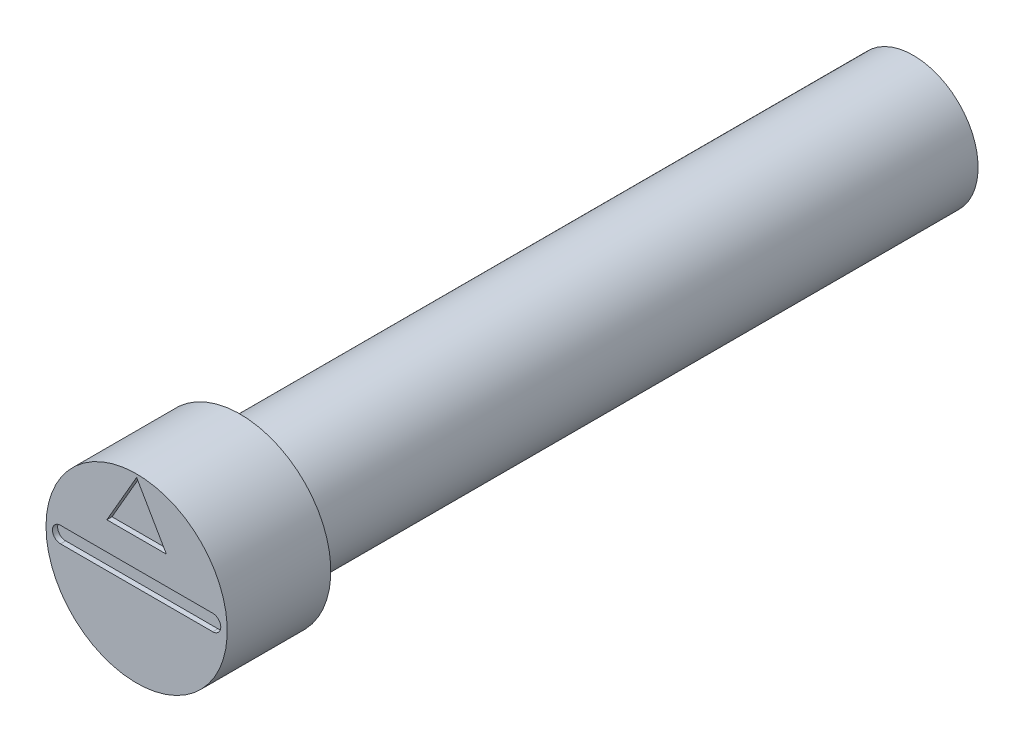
ISO-10303-21;
HEADER;
FILE_DESCRIPTION(('STEP AP214'),'2;1');
FILE_NAME('part.step','',(''),(''),'','','');
FILE_SCHEMA(('AUTOMOTIVE_DESIGN { 1 0 10303 214 1 1 1 1 }'));
ENDSEC;
DATA;
#1=APPLICATION_CONTEXT('core data for automotive mechanical design processes');
#2=APPLICATION_PROTOCOL_DEFINITION('international standard','automotive_design',2000,#1);
#3=PRODUCT_CONTEXT('',#1,'mechanical');
#4=PRODUCT('Part','Part','',(#3));
#5=PRODUCT_RELATED_PRODUCT_CATEGORY('part','',(#4));
#6=PRODUCT_DEFINITION_FORMATION('','',#4);
#7=PRODUCT_DEFINITION_CONTEXT('part definition',#1,'design');
#8=PRODUCT_DEFINITION('design','',#6,#7);
#9=PRODUCT_DEFINITION_SHAPE('','',#8);
#10=(LENGTH_UNIT() NAMED_UNIT(*) SI_UNIT(.MILLI.,.METRE.));
#11=(NAMED_UNIT(*) PLANE_ANGLE_UNIT() SI_UNIT($,.RADIAN.));
#12=(NAMED_UNIT(*) SI_UNIT($,.STERADIAN.) SOLID_ANGLE_UNIT());
#13=UNCERTAINTY_MEASURE_WITH_UNIT(LENGTH_MEASURE(1.E-05),#10,'distance_accuracy_value','');
#14=(GEOMETRIC_REPRESENTATION_CONTEXT(3) GLOBAL_UNCERTAINTY_ASSIGNED_CONTEXT((#13)) GLOBAL_UNIT_ASSIGNED_CONTEXT((#10,
#11,#12)) REPRESENTATION_CONTEXT('',''));
#15=CARTESIAN_POINT('',(0.,0.,0.));
#16=DIRECTION('',(0.,0.,1.));
#17=DIRECTION('',(1.,0.,0.));
#18=AXIS2_PLACEMENT_3D('',#15,#16,#17);
#19=CARTESIAN_POINT('',(0.87499825,0.,0.));
#20=DIRECTION('',(0.,0.,1.));
#21=DIRECTION('',(1.,0.,0.));
#22=AXIS2_PLACEMENT_3D('',#19,#20,#21);
#23=PLANE('',#22);
#24=CARTESIAN_POINT('',(1.47,0.,0.));
#25=DIRECTION('',(0.,0.,1.));
#26=DIRECTION('',(1.,0.,0.));
#27=AXIS2_PLACEMENT_3D('',#24,#25,#26);
#28=CIRCLE('',#27,0.155);
#29=CARTESIAN_POINT('',(1.47,-0.155,0.));
#30=VERTEX_POINT('',#29);
#31=CARTESIAN_POINT('',(1.47,0.155,0.));
#32=VERTEX_POINT('',#31);
#33=EDGE_CURVE('E52',#30,#32,#28,.T.);
#34=ORIENTED_EDGE('',*,*,#33,.F.);
#35=DIRECTION('',(1.,0.,0.));
#36=VECTOR('',#35,1.);
#37=CARTESIAN_POINT('',(-1.47,-0.155,0.));
#38=LINE('',#37,#36);
#39=CARTESIAN_POINT('',(-1.47,-0.155,0.));
#40=VERTEX_POINT('',#39);
#41=EDGE_CURVE('E116',#40,#30,#38,.T.);
#42=ORIENTED_EDGE('',*,*,#41,.F.);
#43=CARTESIAN_POINT('',(-1.47,0.,0.));
#44=DIRECTION('',(0.,0.,1.));
#45=DIRECTION('',(1.,0.,0.));
#46=AXIS2_PLACEMENT_3D('',#43,#44,#45);
#47=CIRCLE('',#46,0.155);
#48=CARTESIAN_POINT('',(-1.47,0.155,0.));
#49=VERTEX_POINT('',#48);
#50=EDGE_CURVE('E119',#49,#40,#47,.T.);
#51=ORIENTED_EDGE('',*,*,#50,.F.);
#52=DIRECTION('',(-1.,0.,0.));
#53=VECTOR('',#52,1.);
#54=CARTESIAN_POINT('',(-1.47,0.155,0.));
#55=LINE('',#54,#53);
#56=EDGE_CURVE('E125',#32,#49,#55,.T.);
#57=ORIENTED_EDGE('',*,*,#56,.F.);
#58=EDGE_LOOP('',(#34,#42,#51,#57));
#59=FACE_BOUND('',#58,.T.);
#60=DIRECTION('',(-0.499999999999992,0.866025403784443,0.));
#61=VECTOR('',#60,1.);
#62=CARTESIAN_POINT('',(0.574999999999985,0.695,0.));
#63=LINE('',#62,#61);
#64=CARTESIAN_POINT('',(0.574999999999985,0.695,0.));
#65=VERTEX_POINT('',#64);
#66=CARTESIAN_POINT('',(0.,1.6909292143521,0.));
#67=VERTEX_POINT('',#66);
#68=EDGE_CURVE('E60',#65,#67,#63,.T.);
#69=ORIENTED_EDGE('',*,*,#68,.F.);
#70=DIRECTION('',(1.,0.,0.));
#71=VECTOR('',#70,1.);
#72=CARTESIAN_POINT('',(-0.575000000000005,0.695,0.));
#73=LINE('',#72,#71);
#74=CARTESIAN_POINT('',(-0.575000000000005,0.695,0.));
#75=VERTEX_POINT('',#74);
#76=EDGE_CURVE('E138',#75,#65,#73,.T.);
#77=ORIENTED_EDGE('',*,*,#76,.F.);
#78=DIRECTION('',(-0.500000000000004,-0.866025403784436,0.));
#79=VECTOR('',#78,1.);
#80=CARTESIAN_POINT('',(0.,1.6909292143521,0.));
#81=LINE('',#80,#79);
#82=EDGE_CURVE('E146',#67,#75,#81,.T.);
#83=ORIENTED_EDGE('',*,*,#82,.F.);
#84=EDGE_LOOP('',(#69,#77,#83));
#85=FACE_BOUND('',#84,.T.);
#86=CARTESIAN_POINT('',(0.,0.,0.));
#87=DIRECTION('',(0.,0.,-1.));
#88=DIRECTION('',(-1.,0.,0.));
#89=AXIS2_PLACEMENT_3D('',#86,#87,#88);
#90=CIRCLE('',#89,1.7499965);
#91=CARTESIAN_POINT('',(-1.74999649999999,0.,0.));
#92=VERTEX_POINT('',#91);
#93=EDGE_CURVE('E39',#92,#92,#90,.T.);
#94=ORIENTED_EDGE('',*,*,#93,.F.);
#95=EDGE_LOOP('',(#94));
#96=FACE_BOUND('',#95,.T.);
#97=ADVANCED_FACE('F36',(#59,#85,#96),#23,.T.);
#98=CARTESIAN_POINT('',(0.,0.,-0.999998));
#99=DIRECTION('',(0.,0.,-1.));
#100=DIRECTION('',(-1.,0.,0.));
#101=AXIS2_PLACEMENT_3D('',#98,#99,#100);
#102=CYLINDRICAL_SURFACE('',#101,1.7499965);
#103=ORIENTED_EDGE('',*,*,#93,.T.);
#104=EDGE_LOOP('',(#103));
#105=FACE_BOUND('',#104,.T.);
#106=CARTESIAN_POINT('',(0.,0.,-1.999996));
#107=DIRECTION('',(0.,0.,-1.));
#108=DIRECTION('',(-1.,0.,0.));
#109=AXIS2_PLACEMENT_3D('',#106,#107,#108);
#110=CIRCLE('',#109,1.7499965);
#111=CARTESIAN_POINT('',(-1.74999649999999,0.,-1.999996));
#112=VERTEX_POINT('',#111);
#113=EDGE_CURVE('E157',#112,#112,#110,.T.);
#114=ORIENTED_EDGE('',*,*,#113,.F.);
#115=EDGE_LOOP('',(#114));
#116=FACE_BOUND('',#115,.T.);
#117=ADVANCED_FACE('F164',(#105,#116),#102,.T.);
#118=CARTESIAN_POINT('',(0.62499875,0.,-14.99997));
#119=DIRECTION('',(0.,0.,-1.));
#120=DIRECTION('',(-1.,0.,0.));
#121=AXIS2_PLACEMENT_3D('',#118,#119,#120);
#122=PLANE('',#121);
#123=CARTESIAN_POINT('',(0.,0.,-14.99997));
#124=DIRECTION('',(0.,0.,-1.));
#125=DIRECTION('',(-1.,0.,0.));
#126=AXIS2_PLACEMENT_3D('',#123,#124,#125);
#127=CIRCLE('',#126,1.2499975);
#128=CARTESIAN_POINT('',(-1.24999749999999,0.,-14.99997));
#129=VERTEX_POINT('',#128);
#130=EDGE_CURVE('E44',#129,#129,#127,.F.);
#131=ORIENTED_EDGE('',*,*,#130,.F.);
#132=EDGE_LOOP('',(#131));
#133=FACE_BOUND('',#132,.T.);
#134=ADVANCED_FACE('F173',(#133),#122,.T.);
#135=CARTESIAN_POINT('',(1.499997,0.,-1.999996));
#136=DIRECTION('',(0.,0.,-1.));
#137=DIRECTION('',(-1.,0.,0.));
#138=AXIS2_PLACEMENT_3D('',#135,#136,#137);
#139=PLANE('',#138);
#140=CARTESIAN_POINT('',(0.,0.,-1.999996));
#141=DIRECTION('',(0.,0.,-1.));
#142=DIRECTION('',(-1.,0.,0.));
#143=AXIS2_PLACEMENT_3D('',#140,#141,#142);
#144=CIRCLE('',#143,1.2499975);
#145=CARTESIAN_POINT('',(-1.24999749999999,0.,-1.999996));
#146=VERTEX_POINT('',#145);
#147=EDGE_CURVE('E11',#146,#146,#144,.T.);
#148=ORIENTED_EDGE('',*,*,#147,.F.);
#149=EDGE_LOOP('',(#148));
#150=FACE_BOUND('',#149,.T.);
#151=ORIENTED_EDGE('',*,*,#113,.T.);
#152=EDGE_LOOP('',(#151));
#153=FACE_BOUND('',#152,.T.);
#154=ADVANCED_FACE('F180',(#150,#153),#139,.T.);
#155=CARTESIAN_POINT('',(0.,0.,-8.499983));
#156=DIRECTION('',(0.,0.,-1.));
#157=DIRECTION('',(-1.,0.,0.));
#158=AXIS2_PLACEMENT_3D('',#155,#156,#157);
#159=CYLINDRICAL_SURFACE('',#158,1.2499975);
#160=ORIENTED_EDGE('',*,*,#130,.T.);
#161=EDGE_LOOP('',(#160));
#162=FACE_BOUND('',#161,.T.);
#163=ORIENTED_EDGE('',*,*,#147,.T.);
#164=EDGE_LOOP('',(#163));
#165=FACE_BOUND('',#164,.T.);
#166=ADVANCED_FACE('F177',(#162,#165),#159,.T.);
#167=CARTESIAN_POINT('',(0.574999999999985,0.695,-0.1));
#168=DIRECTION('',(0.866025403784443,0.499999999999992,0.));
#169=DIRECTION('',(-0.499999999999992,0.866025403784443,0.));
#170=AXIS2_PLACEMENT_3D('',#167,#168,#169);
#171=PLANE('',#170);
#172=ORIENTED_EDGE('',*,*,#68,.T.);
#173=DIRECTION('',(0.,0.,1.));
#174=VECTOR('',#173,1.);
#175=CARTESIAN_POINT('',(0.,1.6909292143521,-0.1));
#176=LINE('',#175,#174);
#177=CARTESIAN_POINT('',(0.,1.6909292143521,-0.1));
#178=VERTEX_POINT('',#177);
#179=EDGE_CURVE('E144',#178,#67,#176,.T.);
#180=ORIENTED_EDGE('',*,*,#179,.F.);
#181=DIRECTION('',(-0.499999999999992,0.866025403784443,0.));
#182=VECTOR('',#181,1.);
#183=CARTESIAN_POINT('',(0.574999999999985,0.695,-0.1));
#184=LINE('',#183,#182);
#185=CARTESIAN_POINT('',(0.574999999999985,0.695,-0.1));
#186=VERTEX_POINT('',#185);
#187=EDGE_CURVE('E134',#186,#178,#184,.T.);
#188=ORIENTED_EDGE('',*,*,#187,.F.);
#189=DIRECTION('',(0.,0.,1.));
#190=VECTOR('',#189,1.);
#191=CARTESIAN_POINT('',(0.574999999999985,0.695,-0.1));
#192=LINE('',#191,#190);
#193=EDGE_CURVE('E151',#186,#65,#192,.T.);
#194=ORIENTED_EDGE('',*,*,#193,.T.);
#195=EDGE_LOOP('',(#172,#180,#188,#194));
#196=FACE_BOUND('',#195,.T.);
#197=ADVANCED_FACE('F169',(#196),#171,.F.);
#198=CARTESIAN_POINT('',(-0.575000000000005,0.695,-0.1));
#199=DIRECTION('',(0.,-1.,0.));
#200=DIRECTION('',(1.,0.,0.));
#201=AXIS2_PLACEMENT_3D('',#198,#199,#200);
#202=PLANE('',#201);
#203=ORIENTED_EDGE('',*,*,#76,.T.);
#204=ORIENTED_EDGE('',*,*,#193,.F.);
#205=DIRECTION('',(1.,0.,0.));
#206=VECTOR('',#205,1.);
#207=CARTESIAN_POINT('',(-0.575000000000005,0.695,-0.1));
#208=LINE('',#207,#206);
#209=CARTESIAN_POINT('',(-0.575000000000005,0.695,-0.1));
#210=VERTEX_POINT('',#209);
#211=EDGE_CURVE('E141',#210,#186,#208,.T.);
#212=ORIENTED_EDGE('',*,*,#211,.F.);
#213=DIRECTION('',(0.,0.,1.));
#214=VECTOR('',#213,1.);
#215=CARTESIAN_POINT('',(-0.575000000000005,0.695,-0.1));
#216=LINE('',#215,#214);
#217=EDGE_CURVE('E153',#210,#75,#216,.T.);
#218=ORIENTED_EDGE('',*,*,#217,.T.);
#219=EDGE_LOOP('',(#203,#204,#212,#218));
#220=FACE_BOUND('',#219,.T.);
#221=ADVANCED_FACE('F176',(#220),#202,.F.);
#222=CARTESIAN_POINT('',(0.,1.6909292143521,-0.1));
#223=DIRECTION('',(-0.866025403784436,0.500000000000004,0.));
#224=DIRECTION('',(-0.500000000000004,-0.866025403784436,0.));
#225=AXIS2_PLACEMENT_3D('',#222,#223,#224);
#226=PLANE('',#225);
#227=ORIENTED_EDGE('',*,*,#82,.T.);
#228=ORIENTED_EDGE('',*,*,#217,.F.);
#229=DIRECTION('',(-0.500000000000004,-0.866025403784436,0.));
#230=VECTOR('',#229,1.);
#231=CARTESIAN_POINT('',(0.,1.6909292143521,-0.1));
#232=LINE('',#231,#230);
#233=EDGE_CURVE('E137',#178,#210,#232,.T.);
#234=ORIENTED_EDGE('',*,*,#233,.F.);
#235=ORIENTED_EDGE('',*,*,#179,.T.);
#236=EDGE_LOOP('',(#227,#228,#234,#235));
#237=FACE_BOUND('',#236,.T.);
#238=ADVANCED_FACE('F232',(#237),#226,.F.);
#239=CARTESIAN_POINT('',(0.,0.,-0.1));
#240=DIRECTION('',(0.,0.,1.));
#241=DIRECTION('',(1.,0.,0.));
#242=AXIS2_PLACEMENT_3D('',#239,#240,#241);
#243=PLANE('',#242);
#244=ORIENTED_EDGE('',*,*,#187,.T.);
#245=ORIENTED_EDGE('',*,*,#233,.T.);
#246=ORIENTED_EDGE('',*,*,#211,.T.);
#247=EDGE_LOOP('',(#244,#245,#246));
#248=FACE_BOUND('',#247,.T.);
#249=ADVANCED_FACE('F243',(#248),#243,.T.);
#250=CARTESIAN_POINT('',(1.47,0.,-0.1));
#251=DIRECTION('',(0.,0.,1.));
#252=DIRECTION('',(1.,0.,0.));
#253=AXIS2_PLACEMENT_3D('',#250,#251,#252);
#254=CYLINDRICAL_SURFACE('',#253,0.155);
#255=ORIENTED_EDGE('',*,*,#33,.T.);
#256=DIRECTION('',(0.,0.,1.));
#257=VECTOR('',#256,1.);
#258=CARTESIAN_POINT('',(1.47,0.155,-0.1));
#259=LINE('',#258,#257);
#260=CARTESIAN_POINT('',(1.47,0.155,-0.1));
#261=VERTEX_POINT('',#260);
#262=EDGE_CURVE('E94',#261,#32,#259,.T.);
#263=ORIENTED_EDGE('',*,*,#262,.F.);
#264=CARTESIAN_POINT('',(1.47,0.,-0.1));
#265=DIRECTION('',(0.,0.,1.));
#266=DIRECTION('',(1.,0.,0.));
#267=AXIS2_PLACEMENT_3D('',#264,#265,#266);
#268=CIRCLE('',#267,0.155);
#269=CARTESIAN_POINT('',(1.47,-0.155,-0.1));
#270=VERTEX_POINT('',#269);
#271=EDGE_CURVE('E98',#270,#261,#268,.T.);
#272=ORIENTED_EDGE('',*,*,#271,.F.);
#273=DIRECTION('',(0.,0.,1.));
#274=VECTOR('',#273,1.);
#275=CARTESIAN_POINT('',(1.47,-0.155,-0.1));
#276=LINE('',#275,#274);
#277=EDGE_CURVE('E129',#270,#30,#276,.T.);
#278=ORIENTED_EDGE('',*,*,#277,.T.);
#279=EDGE_LOOP('',(#255,#263,#272,#278));
#280=FACE_BOUND('',#279,.T.);
#281=ADVANCED_FACE('F96',(#280),#254,.F.);
#282=CARTESIAN_POINT('',(-1.47,-0.155,-0.1));
#283=DIRECTION('',(0.,-1.,0.));
#284=DIRECTION('',(1.,0.,0.));
#285=AXIS2_PLACEMENT_3D('',#282,#283,#284);
#286=PLANE('',#285);
#287=ORIENTED_EDGE('',*,*,#41,.T.);
#288=ORIENTED_EDGE('',*,*,#277,.F.);
#289=DIRECTION('',(1.,0.,0.));
#290=VECTOR('',#289,1.);
#291=CARTESIAN_POINT('',(-1.47,-0.155,-0.1));
#292=LINE('',#291,#290);
#293=CARTESIAN_POINT('',(-1.47,-0.155,-0.1));
#294=VERTEX_POINT('',#293);
#295=EDGE_CURVE('E104',#294,#270,#292,.T.);
#296=ORIENTED_EDGE('',*,*,#295,.F.);
#297=DIRECTION('',(0.,0.,1.));
#298=VECTOR('',#297,1.);
#299=CARTESIAN_POINT('',(-1.47,-0.155,-0.1));
#300=LINE('',#299,#298);
#301=EDGE_CURVE('E131',#294,#40,#300,.T.);
#302=ORIENTED_EDGE('',*,*,#301,.T.);
#303=EDGE_LOOP('',(#287,#288,#296,#302));
#304=FACE_BOUND('',#303,.T.);
#305=ADVANCED_FACE('F263',(#304),#286,.F.);
#306=CARTESIAN_POINT('',(-1.47,0.,-0.1));
#307=DIRECTION('',(0.,0.,1.));
#308=DIRECTION('',(1.,0.,0.));
#309=AXIS2_PLACEMENT_3D('',#306,#307,#308);
#310=CYLINDRICAL_SURFACE('',#309,0.155);
#311=ORIENTED_EDGE('',*,*,#50,.T.);
#312=ORIENTED_EDGE('',*,*,#301,.F.);
#313=CARTESIAN_POINT('',(-1.47,0.,-0.1));
#314=DIRECTION('',(0.,0.,1.));
#315=DIRECTION('',(1.,0.,0.));
#316=AXIS2_PLACEMENT_3D('',#313,#314,#315);
#317=CIRCLE('',#316,0.155);
#318=CARTESIAN_POINT('',(-1.47,0.155,-0.1));
#319=VERTEX_POINT('',#318);
#320=EDGE_CURVE('E112',#319,#294,#317,.T.);
#321=ORIENTED_EDGE('',*,*,#320,.F.);
#322=DIRECTION('',(0.,0.,1.));
#323=VECTOR('',#322,1.);
#324=CARTESIAN_POINT('',(-1.47,0.155,-0.1));
#325=LINE('',#324,#323);
#326=EDGE_CURVE('E103',#319,#49,#325,.T.);
#327=ORIENTED_EDGE('',*,*,#326,.T.);
#328=EDGE_LOOP('',(#311,#312,#321,#327));
#329=FACE_BOUND('',#328,.T.);
#330=ADVANCED_FACE('F273',(#329),#310,.F.);
#331=CARTESIAN_POINT('',(-1.47,0.155,-0.1));
#332=DIRECTION('',(0.,1.,0.));
#333=DIRECTION('',(-1.,0.,0.));
#334=AXIS2_PLACEMENT_3D('',#331,#332,#333);
#335=PLANE('',#334);
#336=ORIENTED_EDGE('',*,*,#56,.T.);
#337=ORIENTED_EDGE('',*,*,#326,.F.);
#338=DIRECTION('',(-1.,0.,0.));
#339=VECTOR('',#338,1.);
#340=CARTESIAN_POINT('',(-1.47,0.155,-0.1));
#341=LINE('',#340,#339);
#342=EDGE_CURVE('E107',#261,#319,#341,.T.);
#343=ORIENTED_EDGE('',*,*,#342,.F.);
#344=ORIENTED_EDGE('',*,*,#262,.T.);
#345=EDGE_LOOP('',(#336,#337,#343,#344));
#346=FACE_BOUND('',#345,.T.);
#347=ADVANCED_FACE('F108',(#346),#335,.F.);
#348=CARTESIAN_POINT('',(1.47,0.,-0.1));
#349=DIRECTION('',(0.,0.,1.));
#350=DIRECTION('',(1.,0.,0.));
#351=AXIS2_PLACEMENT_3D('',#348,#349,#350);
#352=PLANE('',#351);
#353=ORIENTED_EDGE('',*,*,#271,.T.);
#354=ORIENTED_EDGE('',*,*,#342,.T.);
#355=ORIENTED_EDGE('',*,*,#320,.T.);
#356=ORIENTED_EDGE('',*,*,#295,.T.);
#357=EDGE_LOOP('',(#353,#354,#355,#356));
#358=FACE_BOUND('',#357,.T.);
#359=ADVANCED_FACE('F114',(#358),#352,.T.);
#360=CLOSED_SHELL('',(#97,#117,#134,#154,#166,#197,#221,#238,#249,#281,#305,#330,#347,#359));
#361=MANIFOLD_SOLID_BREP('B2',#360);
#362=ADVANCED_BREP_SHAPE_REPRESENTATION('',(#18,#361),#14);
#363=SHAPE_DEFINITION_REPRESENTATION(#9,#362);
ENDSEC;
END-ISO-10303-21;
